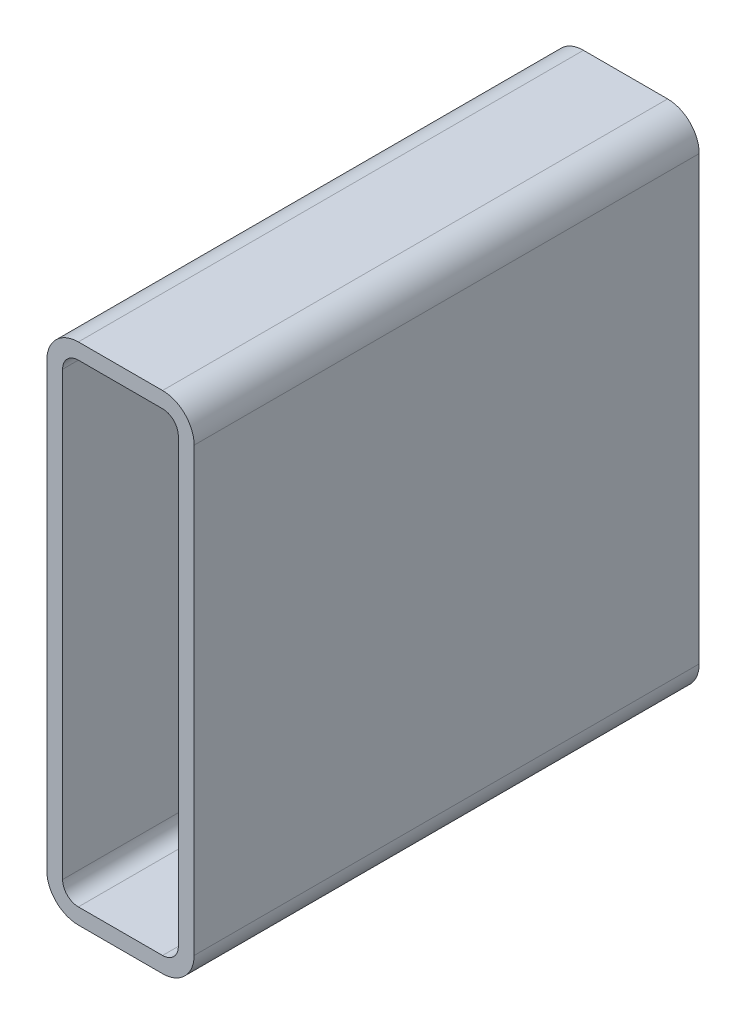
ISO-10303-21;
HEADER;
FILE_DESCRIPTION(('STEP AP214'),'2;1');
FILE_NAME('part.step','',(''),(''),'','','');
FILE_SCHEMA(('AUTOMOTIVE_DESIGN { 1 0 10303 214 1 1 1 1 }'));
ENDSEC;
DATA;
#1=APPLICATION_CONTEXT('core data for automotive mechanical design processes');
#2=APPLICATION_PROTOCOL_DEFINITION('international standard','automotive_design',2000,#1);
#3=PRODUCT_CONTEXT('',#1,'mechanical');
#4=PRODUCT('Part','Part','',(#3));
#5=PRODUCT_RELATED_PRODUCT_CATEGORY('part','',(#4));
#6=PRODUCT_DEFINITION_FORMATION('','',#4);
#7=PRODUCT_DEFINITION_CONTEXT('part definition',#1,'design');
#8=PRODUCT_DEFINITION('design','',#6,#7);
#9=PRODUCT_DEFINITION_SHAPE('','',#8);
#10=(LENGTH_UNIT() NAMED_UNIT(*) SI_UNIT(.MILLI.,.METRE.));
#11=(NAMED_UNIT(*) PLANE_ANGLE_UNIT() SI_UNIT($,.RADIAN.));
#12=(NAMED_UNIT(*) SI_UNIT($,.STERADIAN.) SOLID_ANGLE_UNIT());
#13=UNCERTAINTY_MEASURE_WITH_UNIT(LENGTH_MEASURE(1.E-05),#10,'distance_accuracy_value','');
#14=(GEOMETRIC_REPRESENTATION_CONTEXT(3) GLOBAL_UNCERTAINTY_ASSIGNED_CONTEXT((#13)) GLOBAL_UNIT_ASSIGNED_CONTEXT((#10,
#11,#12)) REPRESENTATION_CONTEXT('',''));
#15=CARTESIAN_POINT('',(0.,0.,0.));
#16=DIRECTION('',(0.,0.,1.));
#17=DIRECTION('',(1.,0.,0.));
#18=AXIS2_PLACEMENT_3D('',#15,#16,#17);
#19=CARTESIAN_POINT('',(21.1321469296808,287.624496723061,304.8));
#20=DIRECTION('',(0.,0.,1.));
#21=DIRECTION('',(1.,0.,0.));
#22=AXIS2_PLACEMENT_3D('',#19,#20,#21);
#23=PLANE('',#22);
#24=CARTESIAN_POINT('',(21.1321469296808,287.624496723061,304.8));
#25=DIRECTION('',(0.,0.,1.));
#26=DIRECTION('',(1.,0.,0.));
#27=AXIS2_PLACEMENT_3D('',#24,#25,#26);
#28=CIRCLE('',#27,19.05);
#29=CARTESIAN_POINT('',(21.1321469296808,306.674496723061,304.8));
#30=VERTEX_POINT('',#29);
#31=CARTESIAN_POINT('',(2.08214692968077,287.624496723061,304.8));
#32=VERTEX_POINT('',#31);
#33=EDGE_CURVE('E211',#30,#32,#28,.T.);
#34=ORIENTED_EDGE('',*,*,#33,.T.);
#35=DIRECTION('',(0.,-1.,0.));
#36=VECTOR('',#35,1.);
#37=CARTESIAN_POINT('',(2.08214692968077,20.9244967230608,304.8));
#38=LINE('',#37,#36);
#39=CARTESIAN_POINT('',(2.08214692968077,20.9244967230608,304.8));
#40=VERTEX_POINT('',#39);
#41=EDGE_CURVE('E214',#32,#40,#38,.T.);
#42=ORIENTED_EDGE('',*,*,#41,.T.);
#43=CARTESIAN_POINT('',(21.1321469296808,20.9244967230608,304.8));
#44=DIRECTION('',(0.,0.,1.));
#45=DIRECTION('',(1.,0.,0.));
#46=AXIS2_PLACEMENT_3D('',#43,#44,#45);
#47=CIRCLE('',#46,19.05);
#48=CARTESIAN_POINT('',(21.1321469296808,1.87449672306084,304.8));
#49=VERTEX_POINT('',#48);
#50=EDGE_CURVE('E217',#40,#49,#47,.T.);
#51=ORIENTED_EDGE('',*,*,#50,.T.);
#52=DIRECTION('',(1.,0.,0.));
#53=VECTOR('',#52,1.);
#54=CARTESIAN_POINT('',(71.9321469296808,1.87449672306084,304.8));
#55=LINE('',#54,#53);
#56=CARTESIAN_POINT('',(71.9321469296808,1.87449672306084,304.8));
#57=VERTEX_POINT('',#56);
#58=EDGE_CURVE('E219',#49,#57,#55,.T.);
#59=ORIENTED_EDGE('',*,*,#58,.T.);
#60=CARTESIAN_POINT('',(71.9321469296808,20.9244967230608,304.8));
#61=DIRECTION('',(0.,0.,1.));
#62=DIRECTION('',(1.,0.,0.));
#63=AXIS2_PLACEMENT_3D('',#60,#61,#62);
#64=CIRCLE('',#63,19.05);
#65=CARTESIAN_POINT('',(90.9821469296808,20.9244967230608,304.8));
#66=VERTEX_POINT('',#65);
#67=EDGE_CURVE('E221',#57,#66,#64,.T.);
#68=ORIENTED_EDGE('',*,*,#67,.T.);
#69=DIRECTION('',(0.,1.,0.));
#70=VECTOR('',#69,1.);
#71=CARTESIAN_POINT('',(90.9821469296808,287.624496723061,304.8));
#72=LINE('',#71,#70);
#73=CARTESIAN_POINT('',(90.9821469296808,287.624496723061,304.8));
#74=VERTEX_POINT('',#73);
#75=EDGE_CURVE('E223',#66,#74,#72,.T.);
#76=ORIENTED_EDGE('',*,*,#75,.T.);
#77=CARTESIAN_POINT('',(71.9321469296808,287.624496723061,304.8));
#78=DIRECTION('',(0.,0.,1.));
#79=DIRECTION('',(1.,0.,0.));
#80=AXIS2_PLACEMENT_3D('',#77,#78,#79);
#81=CIRCLE('',#80,19.05);
#82=CARTESIAN_POINT('',(71.9321469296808,306.674496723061,304.8));
#83=VERTEX_POINT('',#82);
#84=EDGE_CURVE('E225',#74,#83,#81,.T.);
#85=ORIENTED_EDGE('',*,*,#84,.T.);
#86=DIRECTION('',(-1.,0.,0.));
#87=VECTOR('',#86,1.);
#88=CARTESIAN_POINT('',(21.1321469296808,306.674496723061,304.8));
#89=LINE('',#88,#87);
#90=EDGE_CURVE('E227',#83,#30,#89,.T.);
#91=ORIENTED_EDGE('',*,*,#90,.T.);
#92=EDGE_LOOP('',(#34,#42,#51,#59,#68,#76,#85,#91));
#93=FACE_BOUND('',#92,.T.);
#94=DIRECTION('',(0.,-1.,0.));
#95=VECTOR('',#94,1.);
#96=CARTESIAN_POINT('',(11.6071469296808,20.9244967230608,304.8));
#97=LINE('',#96,#95);
#98=CARTESIAN_POINT('',(11.6071469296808,287.624496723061,304.8));
#99=VERTEX_POINT('',#98);
#100=CARTESIAN_POINT('',(11.6071469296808,20.9244967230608,304.8));
#101=VERTEX_POINT('',#100);
#102=EDGE_CURVE('E154',#99,#101,#97,.T.);
#103=ORIENTED_EDGE('',*,*,#102,.F.);
#104=CARTESIAN_POINT('',(21.1321469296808,287.624496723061,304.8));
#105=DIRECTION('',(0.,0.,1.));
#106=DIRECTION('',(1.,0.,0.));
#107=AXIS2_PLACEMENT_3D('',#104,#105,#106);
#108=CIRCLE('',#107,9.52500000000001);
#109=CARTESIAN_POINT('',(21.1321469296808,297.149496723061,304.8));
#110=VERTEX_POINT('',#109);
#111=EDGE_CURVE('E146',#110,#99,#108,.T.);
#112=ORIENTED_EDGE('',*,*,#111,.F.);
#113=DIRECTION('',(-1.,0.,0.));
#114=VECTOR('',#113,1.);
#115=CARTESIAN_POINT('',(21.1321469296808,297.149496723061,304.8));
#116=LINE('',#115,#114);
#117=CARTESIAN_POINT('',(71.9321469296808,297.149496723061,304.8));
#118=VERTEX_POINT('',#117);
#119=EDGE_CURVE('E179',#118,#110,#116,.T.);
#120=ORIENTED_EDGE('',*,*,#119,.F.);
#121=CARTESIAN_POINT('',(71.9321469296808,287.624496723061,304.8));
#122=DIRECTION('',(0.,0.,1.));
#123=DIRECTION('',(1.,0.,0.));
#124=AXIS2_PLACEMENT_3D('',#121,#122,#123);
#125=CIRCLE('',#124,9.525);
#126=CARTESIAN_POINT('',(81.4571469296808,287.624496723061,304.8));
#127=VERTEX_POINT('',#126);
#128=EDGE_CURVE('E177',#127,#118,#125,.T.);
#129=ORIENTED_EDGE('',*,*,#128,.F.);
#130=DIRECTION('',(0.,1.,0.));
#131=VECTOR('',#130,1.);
#132=CARTESIAN_POINT('',(81.4571469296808,287.624496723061,304.8));
#133=LINE('',#132,#131);
#134=CARTESIAN_POINT('',(81.4571469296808,20.9244967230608,304.8));
#135=VERTEX_POINT('',#134);
#136=EDGE_CURVE('E175',#135,#127,#133,.T.);
#137=ORIENTED_EDGE('',*,*,#136,.F.);
#138=CARTESIAN_POINT('',(71.9321469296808,20.9244967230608,304.8));
#139=DIRECTION('',(0.,0.,1.));
#140=DIRECTION('',(1.,0.,0.));
#141=AXIS2_PLACEMENT_3D('',#138,#139,#140);
#142=CIRCLE('',#141,9.525);
#143=CARTESIAN_POINT('',(71.9321469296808,11.3994967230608,304.8));
#144=VERTEX_POINT('',#143);
#145=EDGE_CURVE('E173',#144,#135,#142,.T.);
#146=ORIENTED_EDGE('',*,*,#145,.F.);
#147=DIRECTION('',(1.,0.,0.));
#148=VECTOR('',#147,1.);
#149=CARTESIAN_POINT('',(71.9321469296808,11.3994967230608,304.8));
#150=LINE('',#149,#148);
#151=CARTESIAN_POINT('',(21.1321469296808,11.3994967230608,304.8));
#152=VERTEX_POINT('',#151);
#153=EDGE_CURVE('E169',#152,#144,#150,.T.);
#154=ORIENTED_EDGE('',*,*,#153,.F.);
#155=CARTESIAN_POINT('',(21.1321469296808,20.9244967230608,304.8));
#156=DIRECTION('',(0.,0.,1.));
#157=DIRECTION('',(1.,0.,0.));
#158=AXIS2_PLACEMENT_3D('',#155,#156,#157);
#159=CIRCLE('',#158,9.525);
#160=EDGE_CURVE('E167',#101,#152,#159,.T.);
#161=ORIENTED_EDGE('',*,*,#160,.F.);
#162=EDGE_LOOP('',(#103,#112,#120,#129,#137,#146,#154,#161));
#163=FACE_BOUND('',#162,.T.);
#164=ADVANCED_FACE('F33',(#93,#163),#23,.T.);
#165=CARTESIAN_POINT('',(21.1321469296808,287.624496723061,0.));
#166=DIRECTION('',(0.,0.,1.));
#167=DIRECTION('',(1.,0.,0.));
#168=AXIS2_PLACEMENT_3D('',#165,#166,#167);
#169=PLANE('',#168);
#170=CARTESIAN_POINT('',(21.1321469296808,287.624496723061,0.));
#171=DIRECTION('',(0.,0.,1.));
#172=DIRECTION('',(1.,0.,0.));
#173=AXIS2_PLACEMENT_3D('',#170,#171,#172);
#174=CIRCLE('',#173,19.05);
#175=CARTESIAN_POINT('',(21.1321469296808,306.674496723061,0.));
#176=VERTEX_POINT('',#175);
#177=CARTESIAN_POINT('',(2.08214692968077,287.624496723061,0.));
#178=VERTEX_POINT('',#177);
#179=EDGE_CURVE('E162',#176,#178,#174,.T.);
#180=ORIENTED_EDGE('',*,*,#179,.F.);
#181=DIRECTION('',(-1.,0.,0.));
#182=VECTOR('',#181,1.);
#183=CARTESIAN_POINT('',(21.1321469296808,306.674496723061,0.));
#184=LINE('',#183,#182);
#185=CARTESIAN_POINT('',(71.9321469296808,306.674496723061,0.));
#186=VERTEX_POINT('',#185);
#187=EDGE_CURVE('E215',#186,#176,#184,.T.);
#188=ORIENTED_EDGE('',*,*,#187,.F.);
#189=CARTESIAN_POINT('',(71.9321469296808,287.624496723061,0.));
#190=DIRECTION('',(0.,0.,1.));
#191=DIRECTION('',(1.,0.,0.));
#192=AXIS2_PLACEMENT_3D('',#189,#190,#191);
#193=CIRCLE('',#192,19.05);
#194=CARTESIAN_POINT('',(90.9821469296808,287.624496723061,0.));
#195=VERTEX_POINT('',#194);
#196=EDGE_CURVE('E242',#195,#186,#193,.T.);
#197=ORIENTED_EDGE('',*,*,#196,.F.);
#198=DIRECTION('',(0.,1.,0.));
#199=VECTOR('',#198,1.);
#200=CARTESIAN_POINT('',(90.9821469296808,287.624496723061,0.));
#201=LINE('',#200,#199);
#202=CARTESIAN_POINT('',(90.9821469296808,20.9244967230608,0.));
#203=VERTEX_POINT('',#202);
#204=EDGE_CURVE('E240',#203,#195,#201,.T.);
#205=ORIENTED_EDGE('',*,*,#204,.F.);
#206=CARTESIAN_POINT('',(71.9321469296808,20.9244967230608,0.));
#207=DIRECTION('',(0.,0.,1.));
#208=DIRECTION('',(1.,0.,0.));
#209=AXIS2_PLACEMENT_3D('',#206,#207,#208);
#210=CIRCLE('',#209,19.05);
#211=CARTESIAN_POINT('',(71.9321469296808,1.87449672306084,0.));
#212=VERTEX_POINT('',#211);
#213=EDGE_CURVE('E238',#212,#203,#210,.T.);
#214=ORIENTED_EDGE('',*,*,#213,.F.);
#215=DIRECTION('',(1.,0.,0.));
#216=VECTOR('',#215,1.);
#217=CARTESIAN_POINT('',(71.9321469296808,1.87449672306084,0.));
#218=LINE('',#217,#216);
#219=CARTESIAN_POINT('',(21.1321469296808,1.87449672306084,0.));
#220=VERTEX_POINT('',#219);
#221=EDGE_CURVE('E236',#220,#212,#218,.T.);
#222=ORIENTED_EDGE('',*,*,#221,.F.);
#223=CARTESIAN_POINT('',(21.1321469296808,20.9244967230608,0.));
#224=DIRECTION('',(0.,0.,1.));
#225=DIRECTION('',(1.,0.,0.));
#226=AXIS2_PLACEMENT_3D('',#223,#224,#225);
#227=CIRCLE('',#226,19.05);
#228=CARTESIAN_POINT('',(2.08214692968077,20.9244967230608,0.));
#229=VERTEX_POINT('',#228);
#230=EDGE_CURVE('E234',#229,#220,#227,.T.);
#231=ORIENTED_EDGE('',*,*,#230,.F.);
#232=DIRECTION('',(0.,-1.,0.));
#233=VECTOR('',#232,1.);
#234=CARTESIAN_POINT('',(2.08214692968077,20.9244967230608,0.));
#235=LINE('',#234,#233);
#236=EDGE_CURVE('E232',#178,#229,#235,.T.);
#237=ORIENTED_EDGE('',*,*,#236,.F.);
#238=EDGE_LOOP('',(#180,#188,#197,#205,#214,#222,#231,#237));
#239=FACE_BOUND('',#238,.T.);
#240=CARTESIAN_POINT('',(21.1321469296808,287.624496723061,0.));
#241=DIRECTION('',(0.,0.,1.));
#242=DIRECTION('',(1.,0.,0.));
#243=AXIS2_PLACEMENT_3D('',#240,#241,#242);
#244=CIRCLE('',#243,9.52500000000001);
#245=CARTESIAN_POINT('',(21.1321469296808,297.149496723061,0.));
#246=VERTEX_POINT('',#245);
#247=CARTESIAN_POINT('',(11.6071469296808,287.624496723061,0.));
#248=VERTEX_POINT('',#247);
#249=EDGE_CURVE('E56',#246,#248,#244,.T.);
#250=ORIENTED_EDGE('',*,*,#249,.T.);
#251=DIRECTION('',(0.,-1.,0.));
#252=VECTOR('',#251,1.);
#253=CARTESIAN_POINT('',(11.6071469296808,20.9244967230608,0.));
#254=LINE('',#253,#252);
#255=CARTESIAN_POINT('',(11.6071469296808,20.9244967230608,0.));
#256=VERTEX_POINT('',#255);
#257=EDGE_CURVE('E161',#248,#256,#254,.T.);
#258=ORIENTED_EDGE('',*,*,#257,.T.);
#259=CARTESIAN_POINT('',(21.1321469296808,20.9244967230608,0.));
#260=DIRECTION('',(0.,0.,1.));
#261=DIRECTION('',(1.,0.,0.));
#262=AXIS2_PLACEMENT_3D('',#259,#260,#261);
#263=CIRCLE('',#262,9.525);
#264=CARTESIAN_POINT('',(21.1321469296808,11.3994967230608,0.));
#265=VERTEX_POINT('',#264);
#266=EDGE_CURVE('E183',#256,#265,#263,.T.);
#267=ORIENTED_EDGE('',*,*,#266,.T.);
#268=DIRECTION('',(1.,0.,0.));
#269=VECTOR('',#268,1.);
#270=CARTESIAN_POINT('',(71.9321469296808,11.3994967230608,0.));
#271=LINE('',#270,#269);
#272=CARTESIAN_POINT('',(71.9321469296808,11.3994967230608,0.));
#273=VERTEX_POINT('',#272);
#274=EDGE_CURVE('E186',#265,#273,#271,.T.);
#275=ORIENTED_EDGE('',*,*,#274,.T.);
#276=CARTESIAN_POINT('',(71.9321469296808,20.9244967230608,0.));
#277=DIRECTION('',(0.,0.,1.));
#278=DIRECTION('',(1.,0.,0.));
#279=AXIS2_PLACEMENT_3D('',#276,#277,#278);
#280=CIRCLE('',#279,9.525);
#281=CARTESIAN_POINT('',(81.4571469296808,20.9244967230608,0.));
#282=VERTEX_POINT('',#281);
#283=EDGE_CURVE('E189',#273,#282,#280,.T.);
#284=ORIENTED_EDGE('',*,*,#283,.T.);
#285=DIRECTION('',(0.,1.,0.));
#286=VECTOR('',#285,1.);
#287=CARTESIAN_POINT('',(81.4571469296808,287.624496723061,0.));
#288=LINE('',#287,#286);
#289=CARTESIAN_POINT('',(81.4571469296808,287.624496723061,0.));
#290=VERTEX_POINT('',#289);
#291=EDGE_CURVE('E192',#282,#290,#288,.T.);
#292=ORIENTED_EDGE('',*,*,#291,.T.);
#293=CARTESIAN_POINT('',(71.9321469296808,287.624496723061,0.));
#294=DIRECTION('',(0.,0.,1.));
#295=DIRECTION('',(1.,0.,0.));
#296=AXIS2_PLACEMENT_3D('',#293,#294,#295);
#297=CIRCLE('',#296,9.525);
#298=CARTESIAN_POINT('',(71.9321469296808,297.149496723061,0.));
#299=VERTEX_POINT('',#298);
#300=EDGE_CURVE('E195',#290,#299,#297,.T.);
#301=ORIENTED_EDGE('',*,*,#300,.T.);
#302=DIRECTION('',(-1.,0.,0.));
#303=VECTOR('',#302,1.);
#304=CARTESIAN_POINT('',(21.1321469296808,297.149496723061,0.));
#305=LINE('',#304,#303);
#306=EDGE_CURVE('E155',#299,#246,#305,.T.);
#307=ORIENTED_EDGE('',*,*,#306,.T.);
#308=EDGE_LOOP('',(#250,#258,#267,#275,#284,#292,#301,#307));
#309=FACE_BOUND('',#308,.T.);
#310=ADVANCED_FACE('F272',(#239,#309),#169,.F.);
#311=CARTESIAN_POINT('',(21.1321469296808,287.624496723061,304.8));
#312=DIRECTION('',(0.,0.,-1.));
#313=DIRECTION('',(-1.,0.,0.));
#314=AXIS2_PLACEMENT_3D('',#311,#312,#313);
#315=CYLINDRICAL_SURFACE('',#314,19.05);
#316=ORIENTED_EDGE('',*,*,#179,.T.);
#317=DIRECTION('',(0.,0.,-1.));
#318=VECTOR('',#317,1.);
#319=CARTESIAN_POINT('',(2.08214692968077,287.624496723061,304.8));
#320=LINE('',#319,#318);
#321=EDGE_CURVE('E11',#32,#178,#320,.T.);
#322=ORIENTED_EDGE('',*,*,#321,.F.);
#323=ORIENTED_EDGE('',*,*,#33,.F.);
#324=DIRECTION('',(0.,0.,-1.));
#325=VECTOR('',#324,1.);
#326=CARTESIAN_POINT('',(21.1321469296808,306.674496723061,304.8));
#327=LINE('',#326,#325);
#328=EDGE_CURVE('E229',#30,#176,#327,.T.);
#329=ORIENTED_EDGE('',*,*,#328,.T.);
#330=EDGE_LOOP('',(#316,#322,#323,#329));
#331=FACE_BOUND('',#330,.T.);
#332=ADVANCED_FACE('F35',(#331),#315,.T.);
#333=CARTESIAN_POINT('',(2.08214692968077,20.9244967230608,304.8));
#334=DIRECTION('',(1.,0.,0.));
#335=DIRECTION('',(0.,0.,-1.));
#336=AXIS2_PLACEMENT_3D('',#333,#334,#335);
#337=PLANE('',#336);
#338=ORIENTED_EDGE('',*,*,#236,.T.);
#339=DIRECTION('',(0.,0.,-1.));
#340=VECTOR('',#339,1.);
#341=CARTESIAN_POINT('',(2.08214692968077,20.9244967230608,304.8));
#342=LINE('',#341,#340);
#343=EDGE_CURVE('E41',#40,#229,#342,.T.);
#344=ORIENTED_EDGE('',*,*,#343,.F.);
#345=ORIENTED_EDGE('',*,*,#41,.F.);
#346=ORIENTED_EDGE('',*,*,#321,.T.);
#347=EDGE_LOOP('',(#338,#344,#345,#346));
#348=FACE_BOUND('',#347,.T.);
#349=ADVANCED_FACE('F289',(#348),#337,.F.);
#350=CARTESIAN_POINT('',(21.1321469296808,20.9244967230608,304.8));
#351=DIRECTION('',(0.,0.,-1.));
#352=DIRECTION('',(-1.,0.,0.));
#353=AXIS2_PLACEMENT_3D('',#350,#351,#352);
#354=CYLINDRICAL_SURFACE('',#353,19.05);
#355=ORIENTED_EDGE('',*,*,#230,.T.);
#356=DIRECTION('',(0.,0.,-1.));
#357=VECTOR('',#356,1.);
#358=CARTESIAN_POINT('',(21.1321469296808,1.87449672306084,304.8));
#359=LINE('',#358,#357);
#360=EDGE_CURVE('E259',#49,#220,#359,.T.);
#361=ORIENTED_EDGE('',*,*,#360,.F.);
#362=ORIENTED_EDGE('',*,*,#50,.F.);
#363=ORIENTED_EDGE('',*,*,#343,.T.);
#364=EDGE_LOOP('',(#355,#361,#362,#363));
#365=FACE_BOUND('',#364,.T.);
#366=ADVANCED_FACE('F266',(#365),#354,.T.);
#367=CARTESIAN_POINT('',(71.9321469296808,1.87449672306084,304.8));
#368=DIRECTION('',(0.,1.,0.));
#369=DIRECTION('',(0.,0.,1.));
#370=AXIS2_PLACEMENT_3D('',#367,#368,#369);
#371=PLANE('',#370);
#372=ORIENTED_EDGE('',*,*,#221,.T.);
#373=DIRECTION('',(0.,0.,-1.));
#374=VECTOR('',#373,1.);
#375=CARTESIAN_POINT('',(71.9321469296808,1.87449672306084,304.8));
#376=LINE('',#375,#374);
#377=EDGE_CURVE('E256',#57,#212,#376,.T.);
#378=ORIENTED_EDGE('',*,*,#377,.F.);
#379=ORIENTED_EDGE('',*,*,#58,.F.);
#380=ORIENTED_EDGE('',*,*,#360,.T.);
#381=EDGE_LOOP('',(#372,#378,#379,#380));
#382=FACE_BOUND('',#381,.T.);
#383=ADVANCED_FACE('F278',(#382),#371,.F.);
#384=CARTESIAN_POINT('',(71.9321469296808,20.9244967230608,304.8));
#385=DIRECTION('',(0.,0.,-1.));
#386=DIRECTION('',(-1.,0.,0.));
#387=AXIS2_PLACEMENT_3D('',#384,#385,#386);
#388=CYLINDRICAL_SURFACE('',#387,19.05);
#389=ORIENTED_EDGE('',*,*,#213,.T.);
#390=DIRECTION('',(0.,0.,-1.));
#391=VECTOR('',#390,1.);
#392=CARTESIAN_POINT('',(90.9821469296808,20.9244967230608,304.8));
#393=LINE('',#392,#391);
#394=EDGE_CURVE('E253',#66,#203,#393,.T.);
#395=ORIENTED_EDGE('',*,*,#394,.F.);
#396=ORIENTED_EDGE('',*,*,#67,.F.);
#397=ORIENTED_EDGE('',*,*,#377,.T.);
#398=EDGE_LOOP('',(#389,#395,#396,#397));
#399=FACE_BOUND('',#398,.T.);
#400=ADVANCED_FACE('F282',(#399),#388,.T.);
#401=CARTESIAN_POINT('',(90.9821469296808,287.624496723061,304.8));
#402=DIRECTION('',(-1.,0.,0.));
#403=DIRECTION('',(0.,0.,1.));
#404=AXIS2_PLACEMENT_3D('',#401,#402,#403);
#405=PLANE('',#404);
#406=ORIENTED_EDGE('',*,*,#204,.T.);
#407=DIRECTION('',(0.,0.,-1.));
#408=VECTOR('',#407,1.);
#409=CARTESIAN_POINT('',(90.9821469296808,287.624496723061,304.8));
#410=LINE('',#409,#408);
#411=EDGE_CURVE('E250',#74,#195,#410,.T.);
#412=ORIENTED_EDGE('',*,*,#411,.F.);
#413=ORIENTED_EDGE('',*,*,#75,.F.);
#414=ORIENTED_EDGE('',*,*,#394,.T.);
#415=EDGE_LOOP('',(#406,#412,#413,#414));
#416=FACE_BOUND('',#415,.T.);
#417=ADVANCED_FACE('F302',(#416),#405,.F.);
#418=CARTESIAN_POINT('',(71.9321469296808,287.624496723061,304.8));
#419=DIRECTION('',(0.,0.,-1.));
#420=DIRECTION('',(-1.,0.,0.));
#421=AXIS2_PLACEMENT_3D('',#418,#419,#420);
#422=CYLINDRICAL_SURFACE('',#421,19.05);
#423=ORIENTED_EDGE('',*,*,#196,.T.);
#424=DIRECTION('',(0.,0.,-1.));
#425=VECTOR('',#424,1.);
#426=CARTESIAN_POINT('',(71.9321469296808,306.674496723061,304.8));
#427=LINE('',#426,#425);
#428=EDGE_CURVE('E247',#83,#186,#427,.T.);
#429=ORIENTED_EDGE('',*,*,#428,.F.);
#430=ORIENTED_EDGE('',*,*,#84,.F.);
#431=ORIENTED_EDGE('',*,*,#411,.T.);
#432=EDGE_LOOP('',(#423,#429,#430,#431));
#433=FACE_BOUND('',#432,.T.);
#434=ADVANCED_FACE('F300',(#433),#422,.T.);
#435=CARTESIAN_POINT('',(21.1321469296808,306.674496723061,304.8));
#436=DIRECTION('',(0.,-1.,0.));
#437=DIRECTION('',(0.,0.,-1.));
#438=AXIS2_PLACEMENT_3D('',#435,#436,#437);
#439=PLANE('',#438);
#440=ORIENTED_EDGE('',*,*,#187,.T.);
#441=ORIENTED_EDGE('',*,*,#328,.F.);
#442=ORIENTED_EDGE('',*,*,#90,.F.);
#443=ORIENTED_EDGE('',*,*,#428,.T.);
#444=EDGE_LOOP('',(#440,#441,#442,#443));
#445=FACE_BOUND('',#444,.T.);
#446=ADVANCED_FACE('F295',(#445),#439,.F.);
#447=CARTESIAN_POINT('',(21.1321469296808,287.624496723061,304.8));
#448=DIRECTION('',(0.,0.,-1.));
#449=DIRECTION('',(-1.,0.,0.));
#450=AXIS2_PLACEMENT_3D('',#447,#448,#449);
#451=CYLINDRICAL_SURFACE('',#450,9.52500000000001);
#452=ORIENTED_EDGE('',*,*,#249,.F.);
#453=DIRECTION('',(0.,0.,-1.));
#454=VECTOR('',#453,1.);
#455=CARTESIAN_POINT('',(21.1321469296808,297.149496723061,304.8));
#456=LINE('',#455,#454);
#457=EDGE_CURVE('E150',#110,#246,#456,.T.);
#458=ORIENTED_EDGE('',*,*,#457,.F.);
#459=ORIENTED_EDGE('',*,*,#111,.T.);
#460=DIRECTION('',(0.,0.,-1.));
#461=VECTOR('',#460,1.);
#462=CARTESIAN_POINT('',(11.6071469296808,287.624496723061,304.8));
#463=LINE('',#462,#461);
#464=EDGE_CURVE('E149',#99,#248,#463,.T.);
#465=ORIENTED_EDGE('',*,*,#464,.T.);
#466=EDGE_LOOP('',(#452,#458,#459,#465));
#467=FACE_BOUND('',#466,.T.);
#468=ADVANCED_FACE('F148',(#467),#451,.F.);
#469=CARTESIAN_POINT('',(11.6071469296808,20.9244967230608,304.8));
#470=DIRECTION('',(1.,0.,0.));
#471=DIRECTION('',(0.,0.,-1.));
#472=AXIS2_PLACEMENT_3D('',#469,#470,#471);
#473=PLANE('',#472);
#474=ORIENTED_EDGE('',*,*,#257,.F.);
#475=ORIENTED_EDGE('',*,*,#464,.F.);
#476=ORIENTED_EDGE('',*,*,#102,.T.);
#477=DIRECTION('',(0.,0.,-1.));
#478=VECTOR('',#477,1.);
#479=CARTESIAN_POINT('',(11.6071469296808,20.9244967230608,304.8));
#480=LINE('',#479,#478);
#481=EDGE_CURVE('E163',#101,#256,#480,.T.);
#482=ORIENTED_EDGE('',*,*,#481,.T.);
#483=EDGE_LOOP('',(#474,#475,#476,#482));
#484=FACE_BOUND('',#483,.T.);
#485=ADVANCED_FACE('F158',(#484),#473,.T.);
#486=CARTESIAN_POINT('',(21.1321469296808,20.9244967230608,304.8));
#487=DIRECTION('',(0.,0.,-1.));
#488=DIRECTION('',(-1.,0.,0.));
#489=AXIS2_PLACEMENT_3D('',#486,#487,#488);
#490=CYLINDRICAL_SURFACE('',#489,9.525);
#491=ORIENTED_EDGE('',*,*,#266,.F.);
#492=ORIENTED_EDGE('',*,*,#481,.F.);
#493=ORIENTED_EDGE('',*,*,#160,.T.);
#494=DIRECTION('',(0.,0.,-1.));
#495=VECTOR('',#494,1.);
#496=CARTESIAN_POINT('',(21.1321469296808,11.3994967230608,304.8));
#497=LINE('',#496,#495);
#498=EDGE_CURVE('E208',#152,#265,#497,.T.);
#499=ORIENTED_EDGE('',*,*,#498,.T.);
#500=EDGE_LOOP('',(#491,#492,#493,#499));
#501=FACE_BOUND('',#500,.T.);
#502=ADVANCED_FACE('F327',(#501),#490,.F.);
#503=CARTESIAN_POINT('',(71.9321469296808,11.3994967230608,304.8));
#504=DIRECTION('',(0.,1.,0.));
#505=DIRECTION('',(0.,0.,1.));
#506=AXIS2_PLACEMENT_3D('',#503,#504,#505);
#507=PLANE('',#506);
#508=ORIENTED_EDGE('',*,*,#274,.F.);
#509=ORIENTED_EDGE('',*,*,#498,.F.);
#510=ORIENTED_EDGE('',*,*,#153,.T.);
#511=DIRECTION('',(0.,0.,-1.));
#512=VECTOR('',#511,1.);
#513=CARTESIAN_POINT('',(71.9321469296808,11.3994967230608,304.8));
#514=LINE('',#513,#512);
#515=EDGE_CURVE('E206',#144,#273,#514,.T.);
#516=ORIENTED_EDGE('',*,*,#515,.T.);
#517=EDGE_LOOP('',(#508,#509,#510,#516));
#518=FACE_BOUND('',#517,.T.);
#519=ADVANCED_FACE('F331',(#518),#507,.T.);
#520=CARTESIAN_POINT('',(71.9321469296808,20.9244967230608,304.8));
#521=DIRECTION('',(0.,0.,-1.));
#522=DIRECTION('',(-1.,0.,0.));
#523=AXIS2_PLACEMENT_3D('',#520,#521,#522);
#524=CYLINDRICAL_SURFACE('',#523,9.525);
#525=ORIENTED_EDGE('',*,*,#283,.F.);
#526=ORIENTED_EDGE('',*,*,#515,.F.);
#527=ORIENTED_EDGE('',*,*,#145,.T.);
#528=DIRECTION('',(0.,0.,-1.));
#529=VECTOR('',#528,1.);
#530=CARTESIAN_POINT('',(81.4571469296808,20.9244967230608,304.8));
#531=LINE('',#530,#529);
#532=EDGE_CURVE('E204',#135,#282,#531,.T.);
#533=ORIENTED_EDGE('',*,*,#532,.T.);
#534=EDGE_LOOP('',(#525,#526,#527,#533));
#535=FACE_BOUND('',#534,.T.);
#536=ADVANCED_FACE('F337',(#535),#524,.F.);
#537=CARTESIAN_POINT('',(81.4571469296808,287.624496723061,304.8));
#538=DIRECTION('',(-1.,0.,0.));
#539=DIRECTION('',(0.,0.,1.));
#540=AXIS2_PLACEMENT_3D('',#537,#538,#539);
#541=PLANE('',#540);
#542=ORIENTED_EDGE('',*,*,#291,.F.);
#543=ORIENTED_EDGE('',*,*,#532,.F.);
#544=ORIENTED_EDGE('',*,*,#136,.T.);
#545=DIRECTION('',(0.,0.,-1.));
#546=VECTOR('',#545,1.);
#547=CARTESIAN_POINT('',(81.4571469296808,287.624496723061,304.8));
#548=LINE('',#547,#546);
#549=EDGE_CURVE('E202',#127,#290,#548,.T.);
#550=ORIENTED_EDGE('',*,*,#549,.T.);
#551=EDGE_LOOP('',(#542,#543,#544,#550));
#552=FACE_BOUND('',#551,.T.);
#553=ADVANCED_FACE('F341',(#552),#541,.T.);
#554=CARTESIAN_POINT('',(71.9321469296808,287.624496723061,304.8));
#555=DIRECTION('',(0.,0.,-1.));
#556=DIRECTION('',(-1.,0.,0.));
#557=AXIS2_PLACEMENT_3D('',#554,#555,#556);
#558=CYLINDRICAL_SURFACE('',#557,9.525);
#559=ORIENTED_EDGE('',*,*,#300,.F.);
#560=ORIENTED_EDGE('',*,*,#549,.F.);
#561=ORIENTED_EDGE('',*,*,#128,.T.);
#562=DIRECTION('',(0.,0.,-1.));
#563=VECTOR('',#562,1.);
#564=CARTESIAN_POINT('',(71.9321469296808,297.149496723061,304.8));
#565=LINE('',#564,#563);
#566=EDGE_CURVE('E48',#118,#299,#565,.T.);
#567=ORIENTED_EDGE('',*,*,#566,.T.);
#568=EDGE_LOOP('',(#559,#560,#561,#567));
#569=FACE_BOUND('',#568,.T.);
#570=ADVANCED_FACE('F345',(#569),#558,.F.);
#571=CARTESIAN_POINT('',(21.1321469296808,297.149496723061,304.8));
#572=DIRECTION('',(0.,-1.,0.));
#573=DIRECTION('',(0.,0.,-1.));
#574=AXIS2_PLACEMENT_3D('',#571,#572,#573);
#575=PLANE('',#574);
#576=ORIENTED_EDGE('',*,*,#306,.F.);
#577=ORIENTED_EDGE('',*,*,#566,.F.);
#578=ORIENTED_EDGE('',*,*,#119,.T.);
#579=ORIENTED_EDGE('',*,*,#457,.T.);
#580=EDGE_LOOP('',(#576,#577,#578,#579));
#581=FACE_BOUND('',#580,.T.);
#582=ADVANCED_FACE('F349',(#581),#575,.T.);
#583=CLOSED_SHELL('',(#164,#310,#332,#349,#366,#383,#400,#417,#434,#446,#468,#485,#502,#519,
#536,#553,#570,#582));
#584=MANIFOLD_SOLID_BREP('B2',#583);
#585=ADVANCED_BREP_SHAPE_REPRESENTATION('',(#18,#584),#14);
#586=SHAPE_DEFINITION_REPRESENTATION(#9,#585);
ENDSEC;
END-ISO-10303-21;
